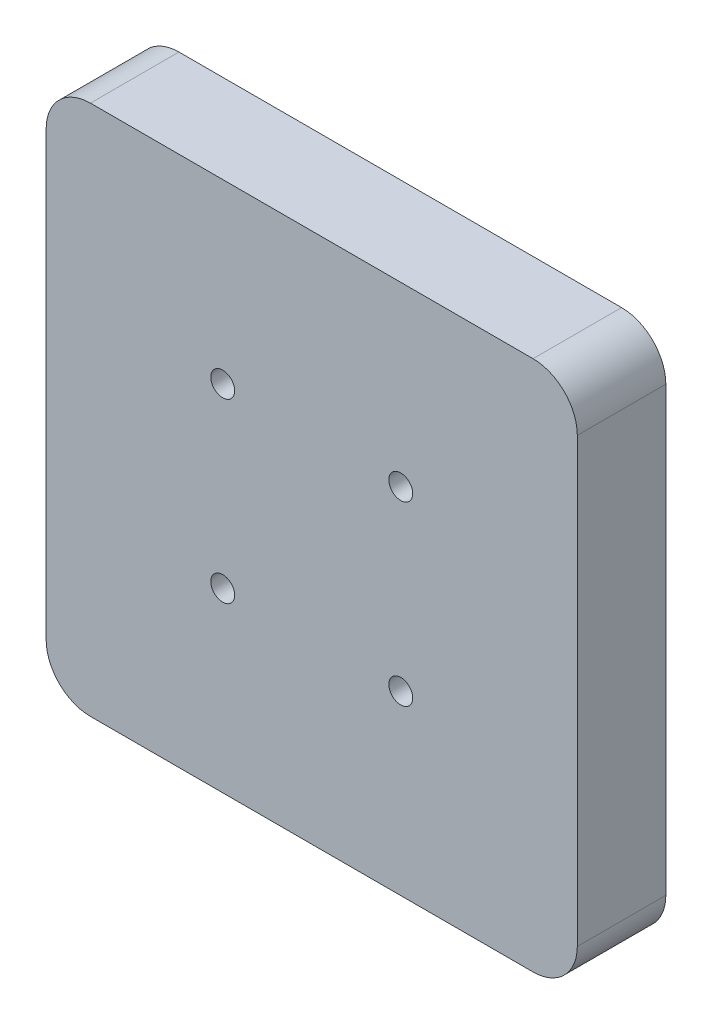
from build123d import *

# Parameters (mm, degrees)
SKETCH3_R           = 2.7
BOSS_EXTRUDE2_DEPTH = 6
SKETCH4_R           = 5
BOSS_EXTRUDE3_DEPTH = 4
SKETCH6_W           = 120
SKETCH6_H           = 120
SKETCH6_W_2         = 110
SKETCH6_H_2         = 110
BOSS_EXTRUDE4_DEPTH = 10
FILLET1_R           = 10


with BuildPart() as part:
    # Sketch3 → Boss-Extrude2 (new body)
    with BuildSketch(Plane.XY):
        Polygon((50, -93.404160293), (50, -33.404160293), (-70, -33.404160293), (-70, -153.404160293), (50, -153.404160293), align=None)
        with Locations((-30.113345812, -73.404160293)):
            Circle(SKETCH3_R, mode=Mode.SUBTRACT)
        with Locations((10.113345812, -73.404160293)):
            Circle(SKETCH3_R, mode=Mode.SUBTRACT)
        with Locations((10.113345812, -113.404160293)):
            Circle(SKETCH3_R, mode=Mode.SUBTRACT)
        with Locations((-30.113345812, -113.404160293)):
            Circle(SKETCH3_R, mode=Mode.SUBTRACT)
    extrude(amount=BOSS_EXTRUDE2_DEPTH)

    # Sketch4 → Boss-Extrude3 (add)
    with BuildSketch(Plane(origin=(0, 0, 0), x_dir=(-1, 0, 0), z_dir=(0, 0, -1))):
        Polygon((70, -93.404160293), (70, -33.404160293), (-50, -33.404160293), (-50, -153.404160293), (70, -153.404160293), align=None)
        with Locations((-10.113345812, -73.404160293)):
            Circle(SKETCH4_R, mode=Mode.SUBTRACT)
        with Locations((30.113345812, -73.404160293)):
            Circle(SKETCH4_R, mode=Mode.SUBTRACT)
        with Locations((30.113345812, -113.404160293)):
            Circle(SKETCH4_R, mode=Mode.SUBTRACT)
        with Locations((-10.113345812, -113.404160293)):
            Circle(SKETCH4_R, mode=Mode.SUBTRACT)
    extrude(amount=BOSS_EXTRUDE3_DEPTH)

    # Sketch6 → Boss-Extrude4 (add)
    with BuildSketch(Plane(origin=(0, 0, -4), x_dir=(-1, 0, 0), z_dir=(0, 0, -1))):
        with Locations((10, -93.404160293)):
            Rectangle(SKETCH6_W, SKETCH6_H)
        with Locations((10, -93.404160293)):
            Rectangle(SKETCH6_W_2, SKETCH6_H_2, mode=Mode.SUBTRACT)
    extrude(amount=BOSS_EXTRUDE4_DEPTH)

    # Fillet1
    fillet1_edges = [part.edges().sort_by_distance(p)[0] for p in [
        (-65, -148.404160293, -9),
        (-65, -38.404160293, -9),
        (45, -38.404160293, -9),
        (45, -148.404160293, -9),
        (50, -153.404160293, -4),
        (-70, -153.404160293, -4),
        (-70, -33.404160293, -4),
        (50, -33.404160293, -4),
    ]]
    fillet(fillet1_edges, radius=FILLET1_R)


solid = part.part
